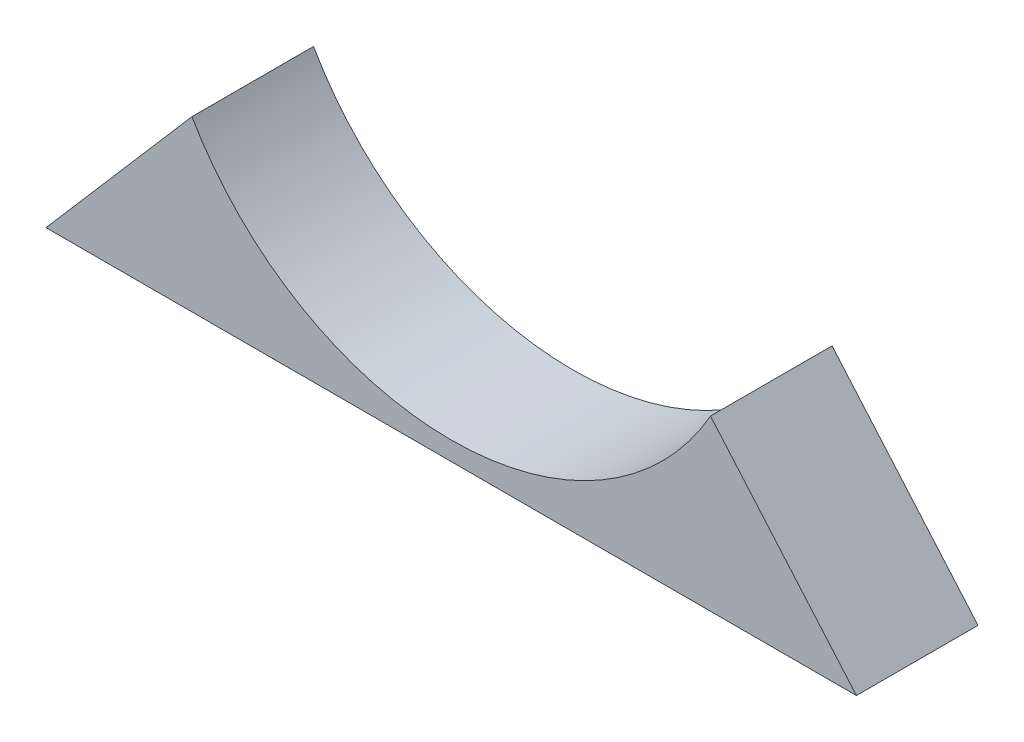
ISO-10303-21;
HEADER;
FILE_DESCRIPTION(('STEP AP214'),'2;1');
FILE_NAME('part.step','',(''),(''),'','','');
FILE_SCHEMA(('AUTOMOTIVE_DESIGN { 1 0 10303 214 1 1 1 1 }'));
ENDSEC;
DATA;
#1=APPLICATION_CONTEXT('core data for automotive mechanical design processes');
#2=APPLICATION_PROTOCOL_DEFINITION('international standard','automotive_design',2000,#1);
#3=PRODUCT_CONTEXT('',#1,'mechanical');
#4=PRODUCT('Part','Part','',(#3));
#5=PRODUCT_RELATED_PRODUCT_CATEGORY('part','',(#4));
#6=PRODUCT_DEFINITION_FORMATION('','',#4);
#7=PRODUCT_DEFINITION_CONTEXT('part definition',#1,'design');
#8=PRODUCT_DEFINITION('design','',#6,#7);
#9=PRODUCT_DEFINITION_SHAPE('','',#8);
#10=(LENGTH_UNIT() NAMED_UNIT(*) SI_UNIT(.MILLI.,.METRE.));
#11=(NAMED_UNIT(*) PLANE_ANGLE_UNIT() SI_UNIT($,.RADIAN.));
#12=(NAMED_UNIT(*) SI_UNIT($,.STERADIAN.) SOLID_ANGLE_UNIT());
#13=UNCERTAINTY_MEASURE_WITH_UNIT(LENGTH_MEASURE(1.E-05),#10,'distance_accuracy_value','');
#14=(GEOMETRIC_REPRESENTATION_CONTEXT(3) GLOBAL_UNCERTAINTY_ASSIGNED_CONTEXT((#13)) GLOBAL_UNIT_ASSIGNED_CONTEXT((#10,
#11,#12)) REPRESENTATION_CONTEXT('',''));
#15=CARTESIAN_POINT('',(0.,0.,0.));
#16=DIRECTION('',(0.,0.,1.));
#17=DIRECTION('',(1.,0.,0.));
#18=AXIS2_PLACEMENT_3D('',#15,#16,#17);
#19=CARTESIAN_POINT('',(-59.5898075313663,-34.0712683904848,27.94));
#20=DIRECTION('',(0.757066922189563,-0.653337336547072,0.));
#21=DIRECTION('',(0.653337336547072,0.757066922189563,0.));
#22=AXIS2_PLACEMENT_3D('',#19,#20,#21);
#23=PLANE('',#22);
#24=DIRECTION('',(-0.653337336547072,-0.757066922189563,0.));
#25=VECTOR('',#24,1.);
#26=CARTESIAN_POINT('',(-59.5898075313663,-34.0712683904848,0.));
#27=LINE('',#26,#25);
#28=CARTESIAN_POINT('',(-59.5898075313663,-34.0712683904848,0.));
#29=VERTEX_POINT('',#28);
#30=CARTESIAN_POINT('',(-93.1294724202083,-72.935985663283,0.));
#31=VERTEX_POINT('',#30);
#32=EDGE_CURVE('E94',#29,#31,#27,.T.);
#33=ORIENTED_EDGE('',*,*,#32,.T.);
#34=DIRECTION('',(0.,0.,-1.));
#35=VECTOR('',#34,1.);
#36=CARTESIAN_POINT('',(-93.1294724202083,-72.935985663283,27.94));
#37=LINE('',#36,#35);
#38=CARTESIAN_POINT('',(-93.1294724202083,-72.935985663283,27.94));
#39=VERTEX_POINT('',#38);
#40=EDGE_CURVE('E11',#39,#31,#37,.T.);
#41=ORIENTED_EDGE('',*,*,#40,.F.);
#42=DIRECTION('',(-0.653337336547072,-0.757066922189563,0.));
#43=VECTOR('',#42,1.);
#44=CARTESIAN_POINT('',(-59.5898075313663,-34.0712683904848,27.94));
#45=LINE('',#44,#43);
#46=CARTESIAN_POINT('',(-59.5898075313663,-34.0712683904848,27.94));
#47=VERTEX_POINT('',#46);
#48=EDGE_CURVE('E82',#47,#39,#45,.T.);
#49=ORIENTED_EDGE('',*,*,#48,.F.);
#50=DIRECTION('',(0.,0.,-1.));
#51=VECTOR('',#50,1.);
#52=CARTESIAN_POINT('',(-59.5898075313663,-34.0712683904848,27.94));
#53=LINE('',#52,#51);
#54=EDGE_CURVE('E90',#47,#29,#53,.T.);
#55=ORIENTED_EDGE('',*,*,#54,.T.);
#56=EDGE_LOOP('',(#33,#41,#49,#55));
#57=FACE_BOUND('',#56,.T.);
#58=ADVANCED_FACE('F31',(#57),#23,.F.);
#59=CARTESIAN_POINT('',(-93.1294724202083,-72.935985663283,27.94));
#60=DIRECTION('',(0.,1.,0.));
#61=DIRECTION('',(0.,0.,1.));
#62=AXIS2_PLACEMENT_3D('',#59,#60,#61);
#63=PLANE('',#62);
#64=DIRECTION('',(1.,0.,0.));
#65=VECTOR('',#64,1.);
#66=CARTESIAN_POINT('',(-93.1294724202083,-72.935985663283,0.));
#67=LINE('',#66,#65);
#68=CARTESIAN_POINT('',(93.1294724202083,-72.935985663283,0.));
#69=VERTEX_POINT('',#68);
#70=EDGE_CURVE('E86',#31,#69,#67,.T.);
#71=ORIENTED_EDGE('',*,*,#70,.T.);
#72=DIRECTION('',(0.,0.,-1.));
#73=VECTOR('',#72,1.);
#74=CARTESIAN_POINT('',(93.1294724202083,-72.935985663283,27.94));
#75=LINE('',#74,#73);
#76=CARTESIAN_POINT('',(93.1294724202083,-72.935985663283,27.94));
#77=VERTEX_POINT('',#76);
#78=EDGE_CURVE('E39',#77,#69,#75,.T.);
#79=ORIENTED_EDGE('',*,*,#78,.F.);
#80=DIRECTION('',(1.,0.,0.));
#81=VECTOR('',#80,1.);
#82=CARTESIAN_POINT('',(-93.1294724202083,-72.935985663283,27.94));
#83=LINE('',#82,#81);
#84=EDGE_CURVE('E77',#39,#77,#83,.T.);
#85=ORIENTED_EDGE('',*,*,#84,.F.);
#86=ORIENTED_EDGE('',*,*,#40,.T.);
#87=EDGE_LOOP('',(#71,#79,#85,#86));
#88=FACE_BOUND('',#87,.T.);
#89=ADVANCED_FACE('F85',(#88),#63,.F.);
#90=CARTESIAN_POINT('',(93.1294724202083,-72.935985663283,27.94));
#91=DIRECTION('',(-0.757066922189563,-0.653337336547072,0.));
#92=DIRECTION('',(0.653337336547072,-0.757066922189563,0.));
#93=AXIS2_PLACEMENT_3D('',#90,#91,#92);
#94=PLANE('',#93);
#95=DIRECTION('',(-0.653337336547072,0.757066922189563,0.));
#96=VECTOR('',#95,1.);
#97=CARTESIAN_POINT('',(93.1294724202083,-72.935985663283,0.));
#98=LINE('',#97,#96);
#99=CARTESIAN_POINT('',(59.5898075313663,-34.0712683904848,0.));
#100=VERTEX_POINT('',#99);
#101=EDGE_CURVE('E64',#69,#100,#98,.T.);
#102=ORIENTED_EDGE('',*,*,#101,.T.);
#103=DIRECTION('',(0.,0.,-1.));
#104=VECTOR('',#103,1.);
#105=CARTESIAN_POINT('',(59.5898075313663,-34.0712683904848,27.94));
#106=LINE('',#105,#104);
#107=CARTESIAN_POINT('',(59.5898075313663,-34.0712683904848,27.94));
#108=VERTEX_POINT('',#107);
#109=EDGE_CURVE('E87',#108,#100,#106,.T.);
#110=ORIENTED_EDGE('',*,*,#109,.F.);
#111=DIRECTION('',(-0.653337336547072,0.757066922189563,0.));
#112=VECTOR('',#111,1.);
#113=CARTESIAN_POINT('',(93.1294724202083,-72.935985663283,27.94));
#114=LINE('',#113,#112);
#115=EDGE_CURVE('E80',#77,#108,#114,.T.);
#116=ORIENTED_EDGE('',*,*,#115,.F.);
#117=ORIENTED_EDGE('',*,*,#78,.T.);
#118=EDGE_LOOP('',(#102,#110,#116,#117));
#119=FACE_BOUND('',#118,.T.);
#120=ADVANCED_FACE('F88',(#119),#94,.F.);
#121=CARTESIAN_POINT('',(0.,0.,27.94));
#122=DIRECTION('',(0.,0.,-1.));
#123=DIRECTION('',(-1.,0.,0.));
#124=AXIS2_PLACEMENT_3D('',#121,#122,#123);
#125=CYLINDRICAL_SURFACE('',#124,68.6425268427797);
#126=CARTESIAN_POINT('',(0.,0.,0.));
#127=DIRECTION('',(0.,0.,-1.));
#128=DIRECTION('',(1.,0.,0.));
#129=AXIS2_PLACEMENT_3D('',#126,#127,#128);
#130=CIRCLE('',#129,68.6425268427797);
#131=EDGE_CURVE('E70',#100,#29,#130,.T.);
#132=ORIENTED_EDGE('',*,*,#131,.T.);
#133=ORIENTED_EDGE('',*,*,#54,.F.);
#134=CARTESIAN_POINT('',(0.,0.,27.94));
#135=DIRECTION('',(0.,0.,-1.));
#136=DIRECTION('',(1.,0.,0.));
#137=AXIS2_PLACEMENT_3D('',#134,#135,#136);
#138=CIRCLE('',#137,68.6425268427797);
#139=EDGE_CURVE('E47',#108,#47,#138,.T.);
#140=ORIENTED_EDGE('',*,*,#139,.F.);
#141=ORIENTED_EDGE('',*,*,#109,.T.);
#142=EDGE_LOOP('',(#132,#133,#140,#141));
#143=FACE_BOUND('',#142,.T.);
#144=ADVANCED_FACE('F101',(#143),#125,.F.);
#145=CARTESIAN_POINT('',(0.,0.,27.94));
#146=DIRECTION('',(0.,0.,1.));
#147=DIRECTION('',(1.,0.,0.));
#148=AXIS2_PLACEMENT_3D('',#145,#146,#147);
#149=PLANE('',#148);
#150=ORIENTED_EDGE('',*,*,#48,.T.);
#151=ORIENTED_EDGE('',*,*,#84,.T.);
#152=ORIENTED_EDGE('',*,*,#115,.T.);
#153=ORIENTED_EDGE('',*,*,#139,.T.);
#154=EDGE_LOOP('',(#150,#151,#152,#153));
#155=FACE_BOUND('',#154,.T.);
#156=ADVANCED_FACE('F78',(#155),#149,.T.);
#157=CARTESIAN_POINT('',(0.,0.,0.));
#158=DIRECTION('',(0.,0.,1.));
#159=DIRECTION('',(1.,0.,0.));
#160=AXIS2_PLACEMENT_3D('',#157,#158,#159);
#161=PLANE('',#160);
#162=ORIENTED_EDGE('',*,*,#32,.F.);
#163=ORIENTED_EDGE('',*,*,#131,.F.);
#164=ORIENTED_EDGE('',*,*,#101,.F.);
#165=ORIENTED_EDGE('',*,*,#70,.F.);
#166=EDGE_LOOP('',(#162,#163,#164,#165));
#167=FACE_BOUND('',#166,.T.);
#168=ADVANCED_FACE('F104',(#167),#161,.F.);
#169=CLOSED_SHELL('',(#58,#89,#120,#144,#156,#168));
#170=MANIFOLD_SOLID_BREP('B2',#169);
#171=ADVANCED_BREP_SHAPE_REPRESENTATION('',(#18,#170),#14);
#172=SHAPE_DEFINITION_REPRESENTATION(#9,#171);
ENDSEC;
END-ISO-10303-21;
